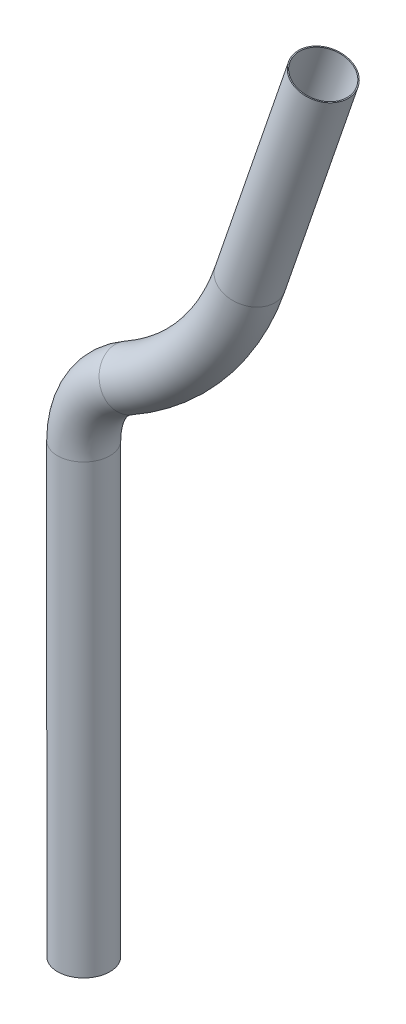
from build123d import *

# Parameters (mm, degrees)
SKETCH1_R   = 6.505717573
SKETCH1_R_2 = 6.251717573


with BuildPart() as part:
    # Sweep-Thin1: sweep along a path in Sketch2
    with BuildLine(Plane.XY) as sweep_thin1_path:
        Line((0, 0), (0, 111.041642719))
        ThreePointArc((0, 111.041642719), (2.969914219, 122.047339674), (11.073295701, 130.064880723))
        ThreePointArc((11.073295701, 130.064880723), (29.54179063, 145.542734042), (41.330812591, 166.558637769))
        Line((41.330812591, 166.558637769), (59.516634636, 219.619210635))
    # Sketch1 → Sweep-Thin1 (sweep)
    with BuildSketch(Plane(origin=(0, 0, 0), x_dir=(1, 0, 0), z_dir=(0, 1, 0))):
        Circle(SKETCH1_R)
        Circle(SKETCH1_R_2, mode=Mode.SUBTRACT)
    sweep(path=sweep_thin1_path.line)


solid = part.part
